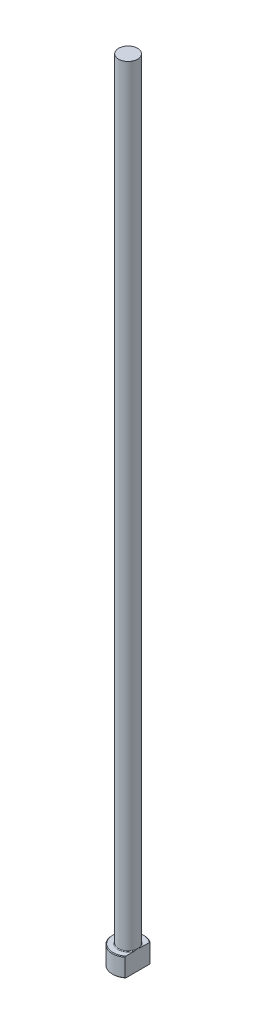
ISO-10303-21;
HEADER;
FILE_DESCRIPTION(('STEP AP214'),'2;1');
FILE_NAME('part.step','',(''),(''),'','','');
FILE_SCHEMA(('AUTOMOTIVE_DESIGN { 1 0 10303 214 1 1 1 1 }'));
ENDSEC;
DATA;
#1=APPLICATION_CONTEXT('core data for automotive mechanical design processes');
#2=APPLICATION_PROTOCOL_DEFINITION('international standard','automotive_design',2000,#1);
#3=PRODUCT_CONTEXT('',#1,'mechanical');
#4=PRODUCT('Part','Part','',(#3));
#5=PRODUCT_RELATED_PRODUCT_CATEGORY('part','',(#4));
#6=PRODUCT_DEFINITION_FORMATION('','',#4);
#7=PRODUCT_DEFINITION_CONTEXT('part definition',#1,'design');
#8=PRODUCT_DEFINITION('design','',#6,#7);
#9=PRODUCT_DEFINITION_SHAPE('','',#8);
#10=(LENGTH_UNIT() NAMED_UNIT(*) SI_UNIT(.MILLI.,.METRE.));
#11=(NAMED_UNIT(*) PLANE_ANGLE_UNIT() SI_UNIT($,.RADIAN.));
#12=(NAMED_UNIT(*) SI_UNIT($,.STERADIAN.) SOLID_ANGLE_UNIT());
#13=UNCERTAINTY_MEASURE_WITH_UNIT(LENGTH_MEASURE(1.E-05),#10,'distance_accuracy_value','');
#14=(GEOMETRIC_REPRESENTATION_CONTEXT(3) GLOBAL_UNCERTAINTY_ASSIGNED_CONTEXT((#13)) GLOBAL_UNIT_ASSIGNED_CONTEXT((#10,
#11,#12)) REPRESENTATION_CONTEXT('',''));
#15=CARTESIAN_POINT('',(0.,0.,0.));
#16=DIRECTION('',(0.,0.,1.));
#17=DIRECTION('',(1.,0.,0.));
#18=AXIS2_PLACEMENT_3D('',#15,#16,#17);
#19=CARTESIAN_POINT('',(0.,0.,0.));
#20=DIRECTION('',(0.,-1.,0.));
#21=DIRECTION('',(0.,0.,-1.));
#22=AXIS2_PLACEMENT_3D('',#19,#20,#21);
#23=PLANE('',#22);
#24=CARTESIAN_POINT('',(0.,0.,0.));
#25=DIRECTION('',(0.,-1.,0.));
#26=DIRECTION('',(0.,0.,-1.));
#27=AXIS2_PLACEMENT_3D('',#24,#25,#26);
#28=CIRCLE('',#27,4.79999999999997);
#29=CARTESIAN_POINT('',(2.99999999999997,0.,3.74699879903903));
#30=VERTEX_POINT('',#29);
#31=CARTESIAN_POINT('',(2.99999999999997,0.,-3.74699879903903));
#32=VERTEX_POINT('',#31);
#33=EDGE_CURVE('E98',#30,#32,#28,.T.);
#34=ORIENTED_EDGE('',*,*,#33,.T.);
#35=DIRECTION('',(0.,0.,1.));
#36=VECTOR('',#35,1.);
#37=CARTESIAN_POINT('',(2.99999999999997,0.,3.99999999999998));
#38=LINE('',#37,#36);
#39=EDGE_CURVE('E83',#32,#30,#38,.T.);
#40=ORIENTED_EDGE('',*,*,#39,.T.);
#41=EDGE_LOOP('',(#34,#40));
#42=FACE_BOUND('',#41,.T.);
#43=ADVANCED_FACE('F32',(#42),#23,.T.);
#44=CARTESIAN_POINT('',(0.,259.958771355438,0.));
#45=DIRECTION('',(0.,1.,0.));
#46=DIRECTION('',(0.,0.,1.));
#47=AXIS2_PLACEMENT_3D('',#44,#45,#46);
#48=CYLINDRICAL_SURFACE('',#47,4.99999999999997);
#49=CARTESIAN_POINT('',(0.,5.80000000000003,0.));
#50=DIRECTION('',(0.,1.,0.));
#51=DIRECTION('',(0.,0.,1.));
#52=AXIS2_PLACEMENT_3D('',#49,#50,#51);
#53=CIRCLE('',#52,4.99999999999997);
#54=CARTESIAN_POINT('',(2.99999999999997,5.80000000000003,3.99999999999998));
#55=VERTEX_POINT('',#54);
#56=CARTESIAN_POINT('',(2.99999999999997,5.80000000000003,-3.99999999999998));
#57=VERTEX_POINT('',#56);
#58=EDGE_CURVE('E104',#55,#57,#53,.F.);
#59=ORIENTED_EDGE('',*,*,#58,.T.);
#60=DIRECTION('',(0.,-1.,0.));
#61=VECTOR('',#60,1.);
#62=CARTESIAN_POINT('',(2.99999999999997,250.,-3.99999999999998));
#63=LINE('',#62,#61);
#64=CARTESIAN_POINT('',(2.99999999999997,0.200000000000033,-3.99999999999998));
#65=VERTEX_POINT('',#64);
#66=EDGE_CURVE('E183',#57,#65,#63,.T.);
#67=ORIENTED_EDGE('',*,*,#66,.T.);
#68=CARTESIAN_POINT('',(0.,0.200000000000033,0.));
#69=DIRECTION('',(0.,-1.,0.));
#70=DIRECTION('',(0.,0.,-1.));
#71=AXIS2_PLACEMENT_3D('',#68,#69,#70);
#72=CIRCLE('',#71,4.99999999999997);
#73=CARTESIAN_POINT('',(2.99999999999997,0.200000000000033,3.99999999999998));
#74=VERTEX_POINT('',#73);
#75=EDGE_CURVE('E100',#65,#74,#72,.F.);
#76=ORIENTED_EDGE('',*,*,#75,.T.);
#77=DIRECTION('',(0.,-1.,0.));
#78=VECTOR('',#77,1.);
#79=CARTESIAN_POINT('',(2.99999999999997,250.,3.99999999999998));
#80=LINE('',#79,#78);
#81=EDGE_CURVE('E93',#55,#74,#80,.T.);
#82=ORIENTED_EDGE('',*,*,#81,.F.);
#83=EDGE_LOOP('',(#59,#67,#76,#82));
#84=FACE_BOUND('',#83,.T.);
#85=ADVANCED_FACE('F158',(#84),#48,.T.);
#86=CARTESIAN_POINT('',(-4.99999999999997,6.,0.));
#87=DIRECTION('',(0.,1.,0.));
#88=DIRECTION('',(0.,0.,1.));
#89=AXIS2_PLACEMENT_3D('',#86,#87,#88);
#90=PLANE('',#89);
#91=CARTESIAN_POINT('',(0.,6.,0.));
#92=DIRECTION('',(0.,1.,0.));
#93=DIRECTION('',(0.,0.,1.));
#94=AXIS2_PLACEMENT_3D('',#91,#92,#93);
#95=CIRCLE('',#94,4.80000000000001);
#96=CARTESIAN_POINT('',(2.99999999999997,6.,-3.74699879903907));
#97=VERTEX_POINT('',#96);
#98=CARTESIAN_POINT('',(2.99999999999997,6.,3.74699879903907));
#99=VERTEX_POINT('',#98);
#100=EDGE_CURVE('E178',#97,#99,#95,.T.);
#101=ORIENTED_EDGE('',*,*,#100,.T.);
#102=DIRECTION('',(0.,0.,-1.));
#103=VECTOR('',#102,1.);
#104=CARTESIAN_POINT('',(2.99999999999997,6.,0.));
#105=LINE('',#104,#103);
#106=CARTESIAN_POINT('',(2.99999999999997,5.99999999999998,1.11355287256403));
#107=VERTEX_POINT('',#106);
#108=EDGE_CURVE('E57',#99,#107,#105,.T.);
#109=ORIENTED_EDGE('',*,*,#108,.T.);
#110=CARTESIAN_POINT('',(0.,6.,0.));
#111=DIRECTION('',(0.,1.,0.));
#112=DIRECTION('',(0.,0.,1.));
#113=AXIS2_PLACEMENT_3D('',#110,#111,#112);
#114=CIRCLE('',#113,3.19999999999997);
#115=CARTESIAN_POINT('',(2.99999999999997,5.99999999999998,-1.113552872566));
#116=VERTEX_POINT('',#115);
#117=EDGE_CURVE('E107',#107,#116,#114,.F.);
#118=ORIENTED_EDGE('',*,*,#117,.T.);
#119=EDGE_CURVE('E136',#116,#97,#105,.T.);
#120=ORIENTED_EDGE('',*,*,#119,.T.);
#121=EDGE_LOOP('',(#101,#109,#118,#120));
#122=FACE_BOUND('',#121,.T.);
#123=ADVANCED_FACE('F147',(#122),#90,.T.);
#124=CARTESIAN_POINT('',(0.,6.00000000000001,0.));
#125=DIRECTION('',(0.,-1.,0.));
#126=DIRECTION('',(0.,0.,-1.));
#127=AXIS2_PLACEMENT_3D('',#124,#125,#126);
#128=CONICAL_SURFACE('',#127,4.8,0.785398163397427);
#129=ORIENTED_EDGE('',*,*,#58,.F.);
#130=CARTESIAN_POINT('',(2.99999999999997,1.50107969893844,8.80169976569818));
#131=CARTESIAN_POINT('',(2.99999999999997,1.63686222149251,8.65824370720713));
#132=CARTESIAN_POINT('',(2.99999999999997,1.77246571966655,8.51461803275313));
#133=CARTESIAN_POINT('',(2.99999999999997,2.04325136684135,8.22696847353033));
#134=CARTESIAN_POINT('',(2.99999999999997,2.1784335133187,8.08294458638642));
#135=CARTESIAN_POINT('',(2.99999999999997,2.5835648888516,7.64985367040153));
#136=CARTESIAN_POINT('',(2.99999999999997,2.85278243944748,7.36010130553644));
#137=CARTESIAN_POINT('',(2.99999999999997,3.40003551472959,6.76562093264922));
#138=CARTESIAN_POINT('',(2.99999999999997,3.67795327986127,6.46078413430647));
#139=CARTESIAN_POINT('',(2.99999999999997,4.09143431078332,6.00077575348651));
#140=CARTESIAN_POINT('',(2.99999999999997,4.22862197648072,5.84706478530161));
#141=CARTESIAN_POINT('',(2.99999999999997,4.50164803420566,5.53845013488));
#142=CARTESIAN_POINT('',(2.99999999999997,4.6374864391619,5.38354646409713));
#143=CARTESIAN_POINT('',(2.99999999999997,4.90727601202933,5.07249257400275));
#144=CARTESIAN_POINT('',(2.99999999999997,5.04122961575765,4.91634447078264));
#145=CARTESIAN_POINT('',(2.99999999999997,5.30697993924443,4.60220522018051));
#146=CARTESIAN_POINT('',(2.99999999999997,5.43877654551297,4.44421397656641));
#147=CARTESIAN_POINT('',(2.99999999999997,5.69999683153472,4.1253404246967));
#148=CARTESIAN_POINT('',(2.99999999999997,5.82941047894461,3.96444987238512));
#149=CARTESIAN_POINT('',(2.99999999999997,6.08438250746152,3.63966784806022));
#150=CARTESIAN_POINT('',(2.99999999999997,6.20994148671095,3.47577684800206));
#151=CARTESIAN_POINT('',(2.99999999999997,6.45325581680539,3.14739812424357));
#152=CARTESIAN_POINT('',(2.99999999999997,6.57111776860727,2.98298986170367));
#153=CARTESIAN_POINT('',(2.99999999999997,6.79968625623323,2.64903166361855));
#154=CARTESIAN_POINT('',(2.99999999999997,6.91038738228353,2.47947797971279));
#155=CARTESIAN_POINT('',(2.99999999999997,7.12046597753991,2.13484547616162));
#156=CARTESIAN_POINT('',(2.99999999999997,7.21990868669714,1.95980688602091));
#157=CARTESIAN_POINT('',(2.99999999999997,7.40271732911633,1.60161809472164));
#158=CARTESIAN_POINT('',(2.99999999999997,7.48611382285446,1.41848414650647));
#159=CARTESIAN_POINT('',(2.99999999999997,7.5908739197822,1.14242184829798));
#160=CARTESIAN_POINT('',(2.99999999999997,7.62169870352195,1.0530881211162));
#161=CARTESIAN_POINT('',(2.99999999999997,7.67691431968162,0.872393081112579));
#162=CARTESIAN_POINT('',(2.99999999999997,7.70130307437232,0.781031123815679));
#163=CARTESIAN_POINT('',(2.99999999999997,7.74245942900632,0.597105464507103));
#164=CARTESIAN_POINT('',(2.99999999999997,7.75926776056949,0.504551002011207));
#165=CARTESIAN_POINT('',(2.99999999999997,7.78456917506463,0.318316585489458));
#166=CARTESIAN_POINT('',(2.99999999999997,7.79306431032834,0.224636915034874));
#167=CARTESIAN_POINT('',(2.99999999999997,7.80126723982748,0.0362345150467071));
#168=CARTESIAN_POINT('',(2.99999999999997,7.80091364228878,-0.0584909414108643));
#169=CARTESIAN_POINT('',(2.99999999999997,7.79128992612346,-0.247479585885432));
#170=CARTESIAN_POINT('',(2.99999999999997,7.78201974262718,-0.341742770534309));
#171=CARTESIAN_POINT('',(2.99999999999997,7.75505711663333,-0.529484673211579));
#172=CARTESIAN_POINT('',(2.99999999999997,7.73732579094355,-0.622957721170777));
#173=CARTESIAN_POINT('',(2.99999999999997,7.69436193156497,-0.808152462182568));
#174=CARTESIAN_POINT('',(2.99999999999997,7.66912783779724,-0.899873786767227));
#175=CARTESIAN_POINT('',(2.99999999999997,7.59536615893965,-1.13513447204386));
#176=CARTESIAN_POINT('',(2.99999999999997,7.54190202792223,-1.27712290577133));
#177=CARTESIAN_POINT('',(2.99999999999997,7.42288064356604,-1.55591594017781));
#178=CARTESIAN_POINT('',(2.99999999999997,7.35731341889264,-1.69271615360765));
#179=CARTESIAN_POINT('',(2.99999999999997,7.21673004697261,-1.96297343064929));
#180=CARTESIAN_POINT('',(2.99999999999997,7.14163008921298,-2.09638641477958));
#181=CARTESIAN_POINT('',(2.99999999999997,7.02409885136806,-2.2935114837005));
#182=CARTESIAN_POINT('',(2.99999999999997,6.98411579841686,-2.35870939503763));
#183=CARTESIAN_POINT('',(2.99999999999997,6.90273519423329,-2.48821412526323));
#184=CARTESIAN_POINT('',(2.99999999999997,6.86133769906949,-2.55252097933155));
#185=CARTESIAN_POINT('',(2.99999999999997,6.72108058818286,-2.76592084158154));
#186=CARTESIAN_POINT('',(2.99999999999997,6.61950942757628,-2.91323263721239));
#187=CARTESIAN_POINT('',(2.99999999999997,6.41158682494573,-3.20445576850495));
#188=CARTESIAN_POINT('',(2.99999999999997,6.30523434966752,-3.34836635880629));
#189=CARTESIAN_POINT('',(2.99999999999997,6.08891481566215,-3.6335882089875));
#190=CARTESIAN_POINT('',(2.99999999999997,5.97894537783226,-3.77489765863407));
#191=CARTESIAN_POINT('',(2.99999999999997,5.75630759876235,-4.05537908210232));
#192=CARTESIAN_POINT('',(2.99999999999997,5.64363910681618,-4.19455093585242));
#193=CARTESIAN_POINT('',(2.99999999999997,5.41585487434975,-4.47160548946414));
#194=CARTESIAN_POINT('',(2.99999999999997,5.30073257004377,-4.60948278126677));
#195=CARTESIAN_POINT('',(2.99999999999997,5.06881951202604,-4.88382857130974));
#196=CARTESIAN_POINT('',(2.99999999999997,4.95202872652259,-5.02029704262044));
#197=CARTESIAN_POINT('',(2.99999999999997,4.59976429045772,-5.42786401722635));
#198=CARTESIAN_POINT('',(2.99999999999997,4.36230070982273,-5.69724186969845));
#199=CARTESIAN_POINT('',(2.99999999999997,3.90791057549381,-6.2058433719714));
#200=CARTESIAN_POINT('',(2.99999999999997,3.69132371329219,-6.4453721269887));
#201=CARTESIAN_POINT('',(2.99999999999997,3.25600753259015,-6.92252604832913));
#202=CARTESIAN_POINT('',(2.99999999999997,3.03727796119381,-7.16015098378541));
#203=CARTESIAN_POINT('',(2.99999999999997,2.59963438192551,-7.63242038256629));
#204=CARTESIAN_POINT('',(2.99999999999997,2.38073043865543,-7.86707418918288));
#205=CARTESIAN_POINT('',(2.99999999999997,1.94172655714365,-8.33519393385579));
#206=CARTESIAN_POINT('',(2.99999999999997,1.7216268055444,-8.56866004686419));
#207=CARTESIAN_POINT('',(2.99999999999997,1.50107969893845,-8.80169976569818));
#208=B_SPLINE_CURVE_WITH_KNOTS('',3,(#130,#131,#132,#133,#134,#135,#136,#137,#138,#139,#140,
#141,#142,#143,#144,#145,#146,#147,#148,#149,#150,#151,#152,#153,#154,#155,#156,#157,#158,#159,
#160,#161,#162,#163,#164,#165,#166,#167,#168,#169,#170,#171,#172,#173,#174,#175,#176,#177,#178,
#179,#180,#181,#182,#183,#184,#185,#186,#187,#188,#189,#190,#191,#192,#193,#194,#195,#196,#197,
#198,#199,#200,#201,#202,#203,#204,#205,#206,#207),.UNSPECIFIED.,.F.,.F.,(4,2,2,2,2,2,2,2,2,2,2,
2,2,2,2,2,2,2,2,2,2,2,2,2,2,2,2,2,2,2,2,2,2,2,2,2,2,2,4),(0.,0.592578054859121,1.18515965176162,
2.37170329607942,3.60919781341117,4.22727570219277,4.84534766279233,5.46252965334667,
6.07974401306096,6.69913968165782,7.3184387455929,7.92518229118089,8.53237898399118,
9.1358544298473,9.73816890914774,10.0214813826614,10.3048852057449,10.5867475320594,
10.8685402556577,11.1522885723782,11.4360389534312,11.7211060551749,12.0062324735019,
12.4605654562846,12.9152744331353,13.3743011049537,13.6037325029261,13.8331548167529,
14.3698070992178,14.9065759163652,15.4437051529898,15.9808644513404,16.5197074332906,
17.058560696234,18.1358079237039,19.1045853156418,20.073478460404,21.0361950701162,
21.9987655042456),.UNSPECIFIED.);
#209=EDGE_CURVE('E135',#55,#99,#208,.T.);
#210=ORIENTED_EDGE('',*,*,#209,.T.);
#211=ORIENTED_EDGE('',*,*,#100,.F.);
#212=EDGE_CURVE('E127',#97,#57,#208,.T.);
#213=ORIENTED_EDGE('',*,*,#212,.T.);
#214=EDGE_LOOP('',(#129,#210,#211,#213));
#215=FACE_BOUND('',#214,.T.);
#216=ADVANCED_FACE('F143',(#215),#128,.T.);
#217=CARTESIAN_POINT('',(0.,0.200000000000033,0.));
#218=DIRECTION('',(0.,1.,0.));
#219=DIRECTION('',(0.,0.,1.));
#220=AXIS2_PLACEMENT_3D('',#217,#218,#219);
#221=CONICAL_SURFACE('',#220,4.99999999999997,0.785398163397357);
#222=ORIENTED_EDGE('',*,*,#75,.F.);
#223=CARTESIAN_POINT('',(2.99999999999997,4.49892030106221,-8.80169976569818));
#224=CARTESIAN_POINT('',(2.99999999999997,4.36313777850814,-8.65824370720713));
#225=CARTESIAN_POINT('',(2.99999999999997,4.22753428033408,-8.51461803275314));
#226=CARTESIAN_POINT('',(2.99999999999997,3.95674863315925,-8.22696847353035));
#227=CARTESIAN_POINT('',(2.99999999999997,3.82156648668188,-8.08294458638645));
#228=CARTESIAN_POINT('',(2.99999999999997,3.41643511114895,-7.64985367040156));
#229=CARTESIAN_POINT('',(2.99999999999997,3.14721756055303,-7.36010130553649));
#230=CARTESIAN_POINT('',(2.99999999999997,2.59996448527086,-6.76562093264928));
#231=CARTESIAN_POINT('',(2.99999999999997,2.32204672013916,-6.46078413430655));
#232=CARTESIAN_POINT('',(2.99999999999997,1.90856568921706,-6.0007757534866));
#233=CARTESIAN_POINT('',(2.99999999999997,1.77137802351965,-5.84706478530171));
#234=CARTESIAN_POINT('',(2.99999999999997,1.49835196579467,-5.5384501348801));
#235=CARTESIAN_POINT('',(2.99999999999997,1.36251356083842,-5.38354646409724));
#236=CARTESIAN_POINT('',(2.99999999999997,1.09272398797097,-5.07249257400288));
#237=CARTESIAN_POINT('',(2.99999999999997,0.958770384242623,-4.91634447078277));
#238=CARTESIAN_POINT('',(2.99999999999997,0.693020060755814,-4.60220522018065));
#239=CARTESIAN_POINT('',(2.99999999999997,0.561223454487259,-4.44421397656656));
#240=CARTESIAN_POINT('',(2.99999999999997,0.300003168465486,-4.12534042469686));
#241=CARTESIAN_POINT('',(2.99999999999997,0.170589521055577,-3.96444987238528));
#242=CARTESIAN_POINT('',(2.99999999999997,-0.0843825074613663,-3.63966784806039));
#243=CARTESIAN_POINT('',(2.99999999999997,-0.209941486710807,-3.47577684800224));
#244=CARTESIAN_POINT('',(2.99999999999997,-0.45325581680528,-3.14739812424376));
#245=CARTESIAN_POINT('',(2.99999999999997,-0.57111776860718,-2.98298986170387));
#246=CARTESIAN_POINT('',(2.99999999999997,-0.799686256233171,-2.64903166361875));
#247=CARTESIAN_POINT('',(2.99999999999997,-0.910387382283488,-2.479477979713));
#248=CARTESIAN_POINT('',(2.99999999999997,-1.12046597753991,-2.13484547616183));
#249=CARTESIAN_POINT('',(2.99999999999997,-1.21990868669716,-1.95980688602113));
#250=CARTESIAN_POINT('',(2.99999999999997,-1.40271732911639,-1.60161809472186));
#251=CARTESIAN_POINT('',(2.99999999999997,-1.48611382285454,-1.4184841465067));
#252=CARTESIAN_POINT('',(2.99999999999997,-1.5908739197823,-1.14242184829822));
#253=CARTESIAN_POINT('',(2.99999999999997,-1.62169870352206,-1.05308812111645));
#254=CARTESIAN_POINT('',(2.99999999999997,-1.67691431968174,-0.872393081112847));
#255=CARTESIAN_POINT('',(2.99999999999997,-1.70130307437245,-0.781031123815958));
#256=CARTESIAN_POINT('',(2.99999999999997,-1.74245942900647,-0.597105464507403));
#257=CARTESIAN_POINT('',(2.99999999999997,-1.75926776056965,-0.504551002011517));
#258=CARTESIAN_POINT('',(2.99999999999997,-1.78456917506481,-0.318316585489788));
#259=CARTESIAN_POINT('',(2.99999999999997,-1.79306431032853,-0.224636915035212));
#260=CARTESIAN_POINT('',(2.99999999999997,-1.80126723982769,-0.0362345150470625));
#261=CARTESIAN_POINT('',(2.99999999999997,-1.800913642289,0.0584909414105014));
#262=CARTESIAN_POINT('',(2.99999999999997,-1.79128992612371,0.247479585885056));
#263=CARTESIAN_POINT('',(2.99999999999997,-1.78201974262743,0.341742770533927));
#264=CARTESIAN_POINT('',(2.99999999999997,-1.75505711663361,0.529484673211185));
#265=CARTESIAN_POINT('',(2.99999999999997,-1.73732579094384,0.622957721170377));
#266=CARTESIAN_POINT('',(2.99999999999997,-1.69436193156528,0.808152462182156));
#267=CARTESIAN_POINT('',(2.99999999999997,-1.66912783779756,0.899873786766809));
#268=CARTESIAN_POINT('',(2.99999999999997,-1.59536615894,1.13513447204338));
#269=CARTESIAN_POINT('',(2.99999999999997,-1.54190202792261,1.2771229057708));
#270=CARTESIAN_POINT('',(2.99999999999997,-1.42288064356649,1.55591594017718));
#271=CARTESIAN_POINT('',(2.99999999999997,-1.35731341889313,1.69271615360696));
#272=CARTESIAN_POINT('',(2.99999999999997,-1.21673004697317,1.9629734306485));
#273=CARTESIAN_POINT('',(2.99999999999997,-1.14163008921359,2.09638641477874));
#274=CARTESIAN_POINT('',(2.99999999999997,-1.02409885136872,2.29351148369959));
#275=CARTESIAN_POINT('',(2.99999999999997,-0.984115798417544,2.3587093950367));
#276=CARTESIAN_POINT('',(2.99999999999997,-0.902735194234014,2.48821412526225));
#277=CARTESIAN_POINT('',(2.99999999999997,-0.861337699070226,2.55252097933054));
#278=CARTESIAN_POINT('',(2.99999999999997,-0.721080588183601,2.76592084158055));
#279=CARTESIAN_POINT('',(2.99999999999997,-0.619509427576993,2.91323263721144));
#280=CARTESIAN_POINT('',(2.99999999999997,-0.411586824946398,3.20445576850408));
#281=CARTESIAN_POINT('',(2.99999999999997,-0.305234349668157,3.34836635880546));
#282=CARTESIAN_POINT('',(2.99999999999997,-0.0889148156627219,3.63358820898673));
#283=CARTESIAN_POINT('',(2.99999999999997,0.0210546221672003,3.77489765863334));
#284=CARTESIAN_POINT('',(2.99999999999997,0.243692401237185,4.05537908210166));
#285=CARTESIAN_POINT('',(2.99999999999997,0.356360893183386,4.19455093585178));
#286=CARTESIAN_POINT('',(2.99999999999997,0.58414512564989,4.47160548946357));
#287=CARTESIAN_POINT('',(2.99999999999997,0.699267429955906,4.60948278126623));
#288=CARTESIAN_POINT('',(2.99999999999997,0.93118048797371,4.88382857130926));
#289=CARTESIAN_POINT('',(2.99999999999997,1.0479712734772,5.02029704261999));
#290=CARTESIAN_POINT('',(2.99999999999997,1.4002357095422,5.42786401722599));
#291=CARTESIAN_POINT('',(2.99999999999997,1.63769929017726,5.69724186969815));
#292=CARTESIAN_POINT('',(2.99999999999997,2.09208942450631,6.20584337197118));
#293=CARTESIAN_POINT('',(2.99999999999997,2.30867628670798,6.4453721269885));
#294=CARTESIAN_POINT('',(2.99999999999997,2.74399246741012,6.92252604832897));
#295=CARTESIAN_POINT('',(2.99999999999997,2.96272203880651,7.16015098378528));
#296=CARTESIAN_POINT('',(2.99999999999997,3.40036561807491,7.63242038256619));
#297=CARTESIAN_POINT('',(2.99999999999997,3.61926956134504,7.86707418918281));
#298=CARTESIAN_POINT('',(2.99999999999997,4.05827344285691,8.33519393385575));
#299=CARTESIAN_POINT('',(2.99999999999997,4.27837319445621,8.56866004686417));
#300=CARTESIAN_POINT('',(2.99999999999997,4.49892030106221,8.80169976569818));
#301=B_SPLINE_CURVE_WITH_KNOTS('',3,(#223,#224,#225,#226,#227,#228,#229,#230,#231,#232,#233,
#234,#235,#236,#237,#238,#239,#240,#241,#242,#243,#244,#245,#246,#247,#248,#249,#250,#251,#252,
#253,#254,#255,#256,#257,#258,#259,#260,#261,#262,#263,#264,#265,#266,#267,#268,#269,#270,#271,
#272,#273,#274,#275,#276,#277,#278,#279,#280,#281,#282,#283,#284,#285,#286,#287,#288,#289,#290,
#291,#292,#293,#294,#295,#296,#297,#298,#299,#300),.UNSPECIFIED.,.F.,.F.,(4,2,2,2,2,2,2,2,2,2,2,
2,2,2,2,2,2,2,2,2,2,2,2,2,2,2,2,2,2,2,2,2,2,2,2,2,2,2,4),(0.,0.592578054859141,1.18515965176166,
2.3717032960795,3.60919781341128,4.22727570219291,4.84534766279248,5.46252965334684,
6.07974401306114,6.69913968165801,7.31843874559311,7.92518229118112,8.53237898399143,
9.13585442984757,9.73816890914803,10.0214813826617,10.3048852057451,10.5867475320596,
10.8685402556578,11.1522885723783,11.4360389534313,11.721106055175,12.006232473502,
12.4605654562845,12.915274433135,13.3743011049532,13.6037325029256,13.8331548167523,
14.3698070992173,14.9065759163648,15.4437051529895,15.9808644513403,16.5197074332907,
17.0585606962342,18.1358079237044,19.1045853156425,20.0734784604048,21.0361950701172,
21.9987655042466),.UNSPECIFIED.);
#302=EDGE_CURVE('E86',#65,#32,#301,.T.);
#303=ORIENTED_EDGE('',*,*,#302,.T.);
#304=ORIENTED_EDGE('',*,*,#33,.F.);
#305=EDGE_CURVE('E89',#30,#74,#301,.T.);
#306=ORIENTED_EDGE('',*,*,#305,.T.);
#307=EDGE_LOOP('',(#222,#303,#304,#306));
#308=FACE_BOUND('',#307,.T.);
#309=ADVANCED_FACE('F97',(#308),#221,.T.);
#310=CARTESIAN_POINT('',(0.,6.19999999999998,0.));
#311=DIRECTION('',(0.,1.,0.));
#312=DIRECTION('',(0.,0.,1.));
#313=AXIS2_PLACEMENT_3D('',#310,#311,#312);
#314=TOROIDAL_SURFACE('',#313,3.19999999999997,0.2);
#315=CARTESIAN_POINT('',(2.99999999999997,6.19999999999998,0.));
#316=CARTESIAN_POINT('',(2.99999999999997,6.20000054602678,-8.25590029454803E-09));
#317=CARTESIAN_POINT('',(2.99999999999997,6.20000108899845,-2.22623717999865E-07));
#318=CARTESIAN_POINT('',(2.99999999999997,6.20000210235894,-8.13181332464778E-07));
#319=CARTESIAN_POINT('',(2.99999999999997,6.20000256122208,-1.20262210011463E-06));
#320=CARTESIAN_POINT('',(2.99999999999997,6.20000351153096,-2.13233194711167E-06));
#321=CARTESIAN_POINT('',(2.99999999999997,6.20000398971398,-2.68711080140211E-06));
#322=CARTESIAN_POINT('',(2.99999999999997,6.20000484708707,-3.8372299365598E-06));
#323=CARTESIAN_POINT('',(2.99999999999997,6.20000522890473,-4.43075975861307E-06));
#324=CARTESIAN_POINT('',(2.99999999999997,6.20000663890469,-6.718054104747E-06));
#325=CARTESIAN_POINT('',(2.99999999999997,6.20000758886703,-8.46267334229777E-06));
#326=CARTESIAN_POINT('',(2.99999999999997,6.20000915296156,-1.19195939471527E-05));
#327=CARTESIAN_POINT('',(2.99999999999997,6.20000978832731,-1.36226968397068E-05));
#328=CARTESIAN_POINT('',(2.99999999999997,6.20001243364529,-2.07785329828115E-05));
#329=CARTESIAN_POINT('',(2.99999999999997,6.20001439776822,-2.62512689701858E-05));
#330=CARTESIAN_POINT('',(2.99999999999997,6.20001730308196,-3.65971254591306E-05));
#331=CARTESIAN_POINT('',(2.99999999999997,6.20001835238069,-4.14397204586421E-05));
#332=CARTESIAN_POINT('',(2.99999999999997,6.20002589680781,-7.68826112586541E-05));
#333=CARTESIAN_POINT('',(2.99999999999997,6.20003169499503,-0.000107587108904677));
#334=CARTESIAN_POINT('',(2.99999999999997,6.20005649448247,-0.000225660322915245));
#335=CARTESIAN_POINT('',(2.99999999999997,6.20007997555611,-0.000312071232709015));
#336=CARTESIAN_POINT('',(2.99999999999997,6.20016717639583,-0.00063874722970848));
#337=CARTESIAN_POINT('',(2.99999999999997,6.20022823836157,-0.00087949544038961));
#338=CARTESIAN_POINT('',(2.99999999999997,6.20046253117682,-0.00179757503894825));
#339=CARTESIAN_POINT('',(2.99999999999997,6.20063826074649,-0.00247448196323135));
#340=CARTESIAN_POINT('',(2.99999999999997,6.20145771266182,-0.00563611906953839));
#341=CARTESIAN_POINT('',(2.99999999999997,6.20209802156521,-0.00812138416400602));
#342=CARTESIAN_POINT('',(2.99999999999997,6.20747052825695,-0.0289666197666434));
#343=CARTESIAN_POINT('',(2.99999999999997,6.21221441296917,-0.0473249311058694));
#344=CARTESIAN_POINT('',(2.99999999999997,6.22150414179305,-0.0833908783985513));
#345=CARTESIAN_POINT('',(2.99999999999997,6.22605099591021,-0.101098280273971));
#346=CARTESIAN_POINT('',(2.99999999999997,6.24071513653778,-0.158441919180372));
#347=CARTESIAN_POINT('',(2.99999999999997,6.25076238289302,-0.198096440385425));
#348=CARTESIAN_POINT('',(2.99999999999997,6.2673587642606,-0.264903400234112));
#349=CARTESIAN_POINT('',(2.99999999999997,6.27400650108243,-0.292031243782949));
#350=CARTESIAN_POINT('',(2.99999999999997,6.28691139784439,-0.345693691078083));
#351=CARTESIAN_POINT('',(2.99999999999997,6.2931740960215,-0.372226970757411));
#352=CARTESIAN_POINT('',(2.99999999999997,6.31359314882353,-0.460847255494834));
#353=CARTESIAN_POINT('',(2.99999999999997,6.32711949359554,-0.523084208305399));
#354=CARTESIAN_POINT('',(2.99999999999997,6.35185224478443,-0.648627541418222));
#355=CARTESIAN_POINT('',(2.99999999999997,6.36303576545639,-0.711938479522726));
#356=CARTESIAN_POINT('',(2.99999999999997,6.38269719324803,-0.845442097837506));
#357=CARTESIAN_POINT('',(2.99999999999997,6.39079783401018,-0.915695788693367));
#358=CARTESIAN_POINT('',(2.99999999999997,6.39788104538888,-1.02128246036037));
#359=CARTESIAN_POINT('',(2.99999999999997,6.39939945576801,-1.05644278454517));
#360=CARTESIAN_POINT('',(2.99999999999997,6.40031405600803,-1.12678521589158));
#361=CARTESIAN_POINT('',(2.99999999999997,6.39971158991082,-1.16196729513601));
#362=CARTESIAN_POINT('',(2.99999999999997,6.39660553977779,-1.21713951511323));
#363=CARTESIAN_POINT('',(2.99999999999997,6.39502683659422,-1.23718181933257));
#364=CARTESIAN_POINT('',(2.99999999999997,6.39080008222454,-1.27717351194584));
#365=CARTESIAN_POINT('',(2.99999999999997,6.38815120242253,-1.29712281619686));
#366=CARTESIAN_POINT('',(2.99999999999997,6.38160570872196,-1.33655702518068));
#367=CARTESIAN_POINT('',(2.99999999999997,6.37772556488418,-1.35604460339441));
#368=CARTESIAN_POINT('',(2.99999999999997,6.36841119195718,-1.39463554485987));
#369=CARTESIAN_POINT('',(2.99999999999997,6.36297874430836,-1.41373932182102));
#370=CARTESIAN_POINT('',(2.99999999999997,6.3500393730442,-1.45151809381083));
#371=CARTESIAN_POINT('',(2.99999999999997,6.34250654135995,-1.4701843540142));
#372=CARTESIAN_POINT('',(2.99999999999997,6.32469433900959,-1.50617232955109));
#373=CARTESIAN_POINT('',(2.99999999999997,6.31442814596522,-1.52349999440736));
#374=CARTESIAN_POINT('',(2.99999999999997,6.29768486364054,-1.5453003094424));
#375=CARTESIAN_POINT('',(2.99999999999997,6.29285641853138,-1.551032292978));
#376=CARTESIAN_POINT('',(2.99999999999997,6.28257691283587,-1.56192749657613));
#377=CARTESIAN_POINT('',(2.99999999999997,6.27712536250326,-1.56709026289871));
#378=CARTESIAN_POINT('',(2.99999999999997,6.26548354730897,-1.57666725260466));
#379=CARTESIAN_POINT('',(2.99999999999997,6.25928560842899,-1.58107232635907));
#380=CARTESIAN_POINT('',(2.99999999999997,6.24620912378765,-1.5887219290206));
#381=CARTESIAN_POINT('',(2.99999999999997,6.23933242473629,-1.59196950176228));
#382=CARTESIAN_POINT('',(2.99999999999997,6.2270240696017,-1.5962468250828));
#383=CARTESIAN_POINT('',(2.99999999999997,6.2217197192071,-1.59764171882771));
#384=CARTESIAN_POINT('',(2.99999999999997,6.2109516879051,-1.59951721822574));
#385=CARTESIAN_POINT('',(2.99999999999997,6.20548813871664,-1.59999855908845));
#386=CARTESIAN_POINT('',(2.99999999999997,6.19455397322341,-1.60000143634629));
#387=CARTESIAN_POINT('',(2.99999999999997,6.18908335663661,-1.59952177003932));
#388=CARTESIAN_POINT('',(2.99999999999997,6.17830149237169,-1.59764696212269));
#389=CARTESIAN_POINT('',(2.99999999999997,6.17299036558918,-1.59625114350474));
#390=CARTESIAN_POINT('',(2.99999999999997,6.16137413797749,-1.5922159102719));
#391=CARTESIAN_POINT('',(2.99999999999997,6.15514663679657,-1.58935479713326));
#392=CARTESIAN_POINT('',(2.99999999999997,6.14323789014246,-1.58266473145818));
#393=CARTESIAN_POINT('',(2.99999999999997,6.13755768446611,-1.57883398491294));
#394=CARTESIAN_POINT('',(2.99999999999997,6.12388989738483,-1.5682309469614));
#395=CARTESIAN_POINT('',(2.99999999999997,6.11627920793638,-1.5609769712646));
#396=CARTESIAN_POINT('',(2.99999999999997,6.10222993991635,-1.54541986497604));
#397=CARTESIAN_POINT('',(2.99999999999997,6.09579438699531,-1.53711411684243));
#398=CARTESIAN_POINT('',(2.99999999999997,6.07874447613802,-1.51234359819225));
#399=CARTESIAN_POINT('',(2.99999999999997,6.06934681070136,-1.49505024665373));
#400=CARTESIAN_POINT('',(2.99999999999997,6.05300413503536,-1.45936637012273));
#401=CARTESIAN_POINT('',(2.99999999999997,6.04606563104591,-1.44097308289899));
#402=CARTESIAN_POINT('',(2.99999999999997,6.03343712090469,-1.40170303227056));
#403=CARTESIAN_POINT('',(2.99999999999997,6.02794514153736,-1.38076360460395));
#404=CARTESIAN_POINT('',(2.99999999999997,6.01869119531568,-1.33849708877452));
#405=CARTESIAN_POINT('',(2.99999999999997,6.01493126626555,-1.31716957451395));
#406=CARTESIAN_POINT('',(2.99999999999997,6.00879575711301,-1.27427301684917));
#407=CARTESIAN_POINT('',(2.99999999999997,6.0064232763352,-1.25270354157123));
#408=CARTESIAN_POINT('',(2.99999999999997,6.00283272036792,-1.2094871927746));
#409=CARTESIAN_POINT('',(2.99999999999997,6.00161392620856,-1.18784037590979));
#410=CARTESIAN_POINT('',(2.99999999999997,5.99921193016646,-1.11739576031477));
#411=CARTESIAN_POINT('',(2.99999999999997,5.99998309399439,-1.06853061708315));
#412=CARTESIAN_POINT('',(2.99999999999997,6.0049845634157,-0.970964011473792));
#413=CARTESIAN_POINT('',(2.99999999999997,6.00921876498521,-0.922262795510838));
#414=CARTESIAN_POINT('',(2.99999999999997,6.02027934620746,-0.825023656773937));
#415=CARTESIAN_POINT('',(2.99999999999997,6.02711306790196,-0.776486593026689));
#416=CARTESIAN_POINT('',(2.99999999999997,6.04272509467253,-0.679720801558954));
#417=CARTESIAN_POINT('',(2.99999999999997,6.05150395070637,-0.631492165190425));
#418=CARTESIAN_POINT('',(2.99999999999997,6.07999589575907,-0.487173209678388));
#419=CARTESIAN_POINT('',(2.99999999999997,6.10185558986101,-0.39151417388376));
#420=CARTESIAN_POINT('',(2.99999999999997,6.14819769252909,-0.200831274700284));
#421=CARTESIAN_POINT('',(2.99999999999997,6.17268119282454,-0.105807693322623));
#422=CARTESIAN_POINT('',(2.99999999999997,6.19722910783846,-0.01073189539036));
#423=CARTESIAN_POINT('',(2.99999999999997,6.1972452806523,-0.0106692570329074));
#424=CARTESIAN_POINT('',(2.99999999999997,6.19781243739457,-0.00847232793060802));
#425=CARTESIAN_POINT('',(2.99999999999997,6.19836102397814,-0.00633759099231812));
#426=CARTESIAN_POINT('',(2.99999999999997,6.19915976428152,-0.00325873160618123));
#427=CARTESIAN_POINT('',(2.99999999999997,6.19940591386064,-0.0023138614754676));
#428=CARTESIAN_POINT('',(2.99999999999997,6.19972567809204,-0.00105818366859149));
#429=CARTESIAN_POINT('',(2.99999999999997,6.1998040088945,-0.000748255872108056));
#430=CARTESIAN_POINT('',(2.99999999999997,6.19991224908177,-0.0003408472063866));
#431=CARTESIAN_POINT('',(2.99999999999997,6.19993871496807,-0.000242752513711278));
#432=CARTESIAN_POINT('',(2.99999999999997,6.1999662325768,-0.000111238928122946));
#433=CARTESIAN_POINT('',(2.99999999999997,6.19997237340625,-7.8903777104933E-05));
#434=CARTESIAN_POINT('',(2.99999999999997,6.19998062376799,-4.17973013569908E-05));
#435=CARTESIAN_POINT('',(2.99999999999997,6.1999817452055,-3.68646326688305E-05));
#436=CARTESIAN_POINT('',(2.99999999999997,6.19998486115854,-2.63337098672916E-05));
#437=CARTESIAN_POINT('',(2.99999999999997,6.19998697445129,-2.07707790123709E-05));
#438=CARTESIAN_POINT('',(2.99999999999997,6.19998981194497,-1.35213137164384E-05));
#439=CARTESIAN_POINT('',(2.99999999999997,6.19999048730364,-1.18115060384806E-05));
#440=CARTESIAN_POINT('',(2.99999999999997,6.19999214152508,-8.34771964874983E-06));
#441=CARTESIAN_POINT('',(2.99999999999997,6.19999314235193,-6.60378872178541E-06));
#442=CARTESIAN_POINT('',(2.99999999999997,6.19999462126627,-4.32501646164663E-06));
#443=CARTESIAN_POINT('',(2.99999999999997,6.19999502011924,-3.73587510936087E-06));
#444=CARTESIAN_POINT('',(2.99999999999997,6.19999591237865,-2.59760769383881E-06));
#445=CARTESIAN_POINT('',(2.99999999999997,6.19999640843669,-2.05040430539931E-06));
#446=CARTESIAN_POINT('',(2.99999999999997,6.19999738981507,-1.1384674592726E-06));
#447=CARTESIAN_POINT('',(2.99999999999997,6.1999978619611,-7.58552555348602E-07));
#448=CARTESIAN_POINT('',(2.99999999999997,6.19999889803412,-1.92079007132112E-07));
#449=CARTESIAN_POINT('',(2.99999999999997,6.19999945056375,8.30745072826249E-09));
#450=CARTESIAN_POINT('',(2.99999999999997,6.19999999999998,0.));
#451=B_SPLINE_CURVE_WITH_KNOTS('',3,(#315,#316,#317,#318,#319,#320,#321,#322,#323,#324,#325,
#326,#327,#328,#329,#330,#331,#332,#333,#334,#335,#336,#337,#338,#339,#340,#341,#342,#343,#344,
#345,#346,#347,#348,#349,#350,#351,#352,#353,#354,#355,#356,#357,#358,#359,#360,#361,#362,#363,
#364,#365,#366,#367,#368,#369,#370,#371,#372,#373,#374,#375,#376,#377,#378,#379,#380,#381,#382,
#383,#384,#385,#386,#387,#388,#389,#390,#391,#392,#393,#394,#395,#396,#397,#398,#399,#400,#401,
#402,#403,#404,#405,#406,#407,#408,#409,#410,#411,#412,#413,#414,#415,#416,#417,#418,#419,#420,
#421,#422,#423,#424,#425,#426,#427,#428,#429,#430,#431,#432,#433,#434,#435,#436,#437,#438,#439,
#440,#441,#442,#443,#444,#445,#446,#447,#448,#449,#450),.UNSPECIFIED.,.T.,.F.,(4,2,2,2,2,2,2,2,
2,2,2,2,2,2,2,2,2,2,2,2,2,2,2,2,2,2,2,2,2,2,2,2,2,2,2,2,2,2,2,2,2,2,2,2,2,2,2,2,2,2,2,2,2,2,2,2,
2,2,2,2,2,2,2,2,2,2,2,4),(0.,1.65204690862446E-06,3.45848791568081E-06,5.64280248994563E-06,
7.75882419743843E-06,1.36969709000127E-05,1.91454439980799E-05,3.65603921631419E-05,
5.14083081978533E-05,0.000145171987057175,0.00041354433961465,0.00115890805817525,
0.00325667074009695,0.0109563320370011,0.0678386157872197,0.12268455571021,0.245405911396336,
0.329196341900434,0.410983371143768,0.602016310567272,0.794836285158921,1.0067376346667,
1.11227258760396,1.21774067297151,1.27803175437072,1.33836960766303,1.39793215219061,
1.45742661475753,1.51769013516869,1.57766822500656,1.60011625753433,1.62258205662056,
1.64530254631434,1.66796284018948,1.68434680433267,1.70071757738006,1.71710885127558,
1.7335122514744,1.75395806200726,1.77444198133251,1.8058056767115,1.83724902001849,
1.89596356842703,1.95483231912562,2.01967230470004,2.08458838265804,2.14964892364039,
2.21466889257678,2.36107995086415,2.50765595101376,2.65464904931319,2.8016838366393,
3.09594779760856,3.39033467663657,3.39052875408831,3.39714155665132,3.40007033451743,
3.40102967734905,3.40133420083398,3.40143296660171,3.40144812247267,3.4014659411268,
3.40147145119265,3.40147746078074,3.40147959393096,3.40148179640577,3.40148361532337,
3.40148527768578),.UNSPECIFIED.);
#452=CARTESIAN_POINT('',(2.99999999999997,6.19999999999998,0.));
#453=VERTEX_POINT('',#452);
#454=EDGE_CURVE('E11',#116,#453,#451,.T.);
#455=ORIENTED_EDGE('',*,*,#454,.F.);
#456=ORIENTED_EDGE('',*,*,#117,.F.);
#457=CARTESIAN_POINT('',(2.99999999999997,6.19999999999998,0.));
#458=CARTESIAN_POINT('',(2.99999999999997,6.19999945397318,8.25590052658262E-09));
#459=CARTESIAN_POINT('',(2.99999999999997,6.19999891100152,2.22623718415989E-07));
#460=CARTESIAN_POINT('',(2.99999999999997,6.19999789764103,8.13181332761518E-07));
#461=CARTESIAN_POINT('',(2.99999999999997,6.19999743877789,1.2026221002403E-06));
#462=CARTESIAN_POINT('',(2.99999999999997,6.19999648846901,2.13233194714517E-06));
#463=CARTESIAN_POINT('',(2.99999999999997,6.19999601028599,2.68711080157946E-06));
#464=CARTESIAN_POINT('',(2.99999999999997,6.1999951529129,3.83722993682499E-06));
#465=CARTESIAN_POINT('',(2.99999999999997,6.19999477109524,4.43075975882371E-06));
#466=CARTESIAN_POINT('',(2.99999999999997,6.19999336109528,6.7180541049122E-06));
#467=CARTESIAN_POINT('',(2.99999999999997,6.19999241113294,8.4626733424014E-06));
#468=CARTESIAN_POINT('',(2.99999999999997,6.19999084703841,1.19195939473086E-05));
#469=CARTESIAN_POINT('',(2.99999999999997,6.19999021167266,1.36226968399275E-05));
#470=CARTESIAN_POINT('',(2.99999999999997,6.19998756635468,2.07785329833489E-05));
#471=CARTESIAN_POINT('',(2.99999999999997,6.19998560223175,2.62512689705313E-05));
#472=CARTESIAN_POINT('',(2.99999999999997,6.19998269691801,3.65971254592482E-05));
#473=CARTESIAN_POINT('',(2.99999999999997,6.19998164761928,4.14397204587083E-05));
#474=CARTESIAN_POINT('',(2.99999999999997,6.19997410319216,7.68826112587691E-05));
#475=CARTESIAN_POINT('',(2.99999999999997,6.19996830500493,0.000107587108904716));
#476=CARTESIAN_POINT('',(2.99999999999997,6.1999435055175,0.000225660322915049));
#477=CARTESIAN_POINT('',(2.99999999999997,6.19992002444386,0.000312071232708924));
#478=CARTESIAN_POINT('',(2.99999999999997,6.19983282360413,0.000638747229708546));
#479=CARTESIAN_POINT('',(2.99999999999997,6.1997717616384,0.000879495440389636));
#480=CARTESIAN_POINT('',(2.99999999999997,6.19953746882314,0.00179757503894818));
#481=CARTESIAN_POINT('',(2.99999999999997,6.19936173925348,0.00247448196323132));
#482=CARTESIAN_POINT('',(2.99999999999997,6.19854228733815,0.0056361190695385));
#483=CARTESIAN_POINT('',(2.99999999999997,6.19790197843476,0.00812138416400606));
#484=CARTESIAN_POINT('',(2.99999999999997,6.19252947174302,0.0289666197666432));
#485=CARTESIAN_POINT('',(2.99999999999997,6.1877855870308,0.0473249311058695));
#486=CARTESIAN_POINT('',(2.99999999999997,6.17849585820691,0.0833908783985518));
#487=CARTESIAN_POINT('',(2.99999999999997,6.17394900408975,0.101098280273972));
#488=CARTESIAN_POINT('',(2.99999999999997,6.15928486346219,0.158441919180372));
#489=CARTESIAN_POINT('',(2.99999999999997,6.14923761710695,0.198096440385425));
#490=CARTESIAN_POINT('',(2.99999999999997,6.13264123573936,0.264903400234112));
#491=CARTESIAN_POINT('',(2.99999999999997,6.12599349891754,0.292031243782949));
#492=CARTESIAN_POINT('',(2.99999999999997,6.11308860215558,0.345693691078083));
#493=CARTESIAN_POINT('',(2.99999999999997,6.10682590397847,0.372226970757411));
#494=CARTESIAN_POINT('',(2.99999999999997,6.08640685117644,0.460847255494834));
#495=CARTESIAN_POINT('',(2.99999999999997,6.07288050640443,0.523084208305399));
#496=CARTESIAN_POINT('',(2.99999999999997,6.04814775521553,0.648627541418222));
#497=CARTESIAN_POINT('',(2.99999999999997,6.03696423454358,0.711938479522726));
#498=CARTESIAN_POINT('',(2.99999999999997,6.01730280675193,0.845442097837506));
#499=CARTESIAN_POINT('',(2.99999999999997,6.00920216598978,0.915695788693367));
#500=CARTESIAN_POINT('',(2.99999999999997,6.00211895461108,1.02128246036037));
#501=CARTESIAN_POINT('',(2.99999999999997,6.00060054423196,1.05644278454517));
#502=CARTESIAN_POINT('',(2.99999999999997,5.99968594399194,1.12678521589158));
#503=CARTESIAN_POINT('',(2.99999999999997,6.00028841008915,1.16196729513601));
#504=CARTESIAN_POINT('',(2.99999999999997,6.00339446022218,1.21713951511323));
#505=CARTESIAN_POINT('',(2.99999999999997,6.00497316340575,1.23718181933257));
#506=CARTESIAN_POINT('',(2.99999999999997,6.00919991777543,1.27717351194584));
#507=CARTESIAN_POINT('',(2.99999999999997,6.01184879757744,1.29712281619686));
#508=CARTESIAN_POINT('',(2.99999999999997,6.01839429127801,1.33655702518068));
#509=CARTESIAN_POINT('',(2.99999999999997,6.02227443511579,1.35604460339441));
#510=CARTESIAN_POINT('',(2.99999999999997,6.03158880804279,1.39463554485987));
#511=CARTESIAN_POINT('',(2.99999999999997,6.0370212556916,1.41373932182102));
#512=CARTESIAN_POINT('',(2.99999999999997,6.04996062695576,1.45151809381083));
#513=CARTESIAN_POINT('',(2.99999999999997,6.05749345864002,1.4701843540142));
#514=CARTESIAN_POINT('',(2.99999999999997,6.07530566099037,1.50617232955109));
#515=CARTESIAN_POINT('',(2.99999999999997,6.08557185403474,1.52349999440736));
#516=CARTESIAN_POINT('',(2.99999999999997,6.10231513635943,1.5453003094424));
#517=CARTESIAN_POINT('',(2.99999999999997,6.10714358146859,1.551032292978));
#518=CARTESIAN_POINT('',(2.99999999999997,6.1174230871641,1.56192749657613));
#519=CARTESIAN_POINT('',(2.99999999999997,6.1228746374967,1.56709026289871));
#520=CARTESIAN_POINT('',(2.99999999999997,6.13451645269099,1.57666725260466));
#521=CARTESIAN_POINT('',(2.99999999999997,6.14071439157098,1.58107232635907));
#522=CARTESIAN_POINT('',(2.99999999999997,6.15379087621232,1.5887219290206));
#523=CARTESIAN_POINT('',(2.99999999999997,6.16066757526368,1.59196950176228));
#524=CARTESIAN_POINT('',(2.99999999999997,6.17297593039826,1.5962468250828));
#525=CARTESIAN_POINT('',(2.99999999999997,6.17828028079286,1.59764171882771));
#526=CARTESIAN_POINT('',(2.99999999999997,6.18904831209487,1.59951721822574));
#527=CARTESIAN_POINT('',(2.99999999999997,6.19451186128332,1.59999855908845));
#528=CARTESIAN_POINT('',(2.99999999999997,6.20544602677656,1.60000143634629));
#529=CARTESIAN_POINT('',(2.99999999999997,6.21091664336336,1.59952177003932));
#530=CARTESIAN_POINT('',(2.99999999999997,6.22169850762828,1.59764696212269));
#531=CARTESIAN_POINT('',(2.99999999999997,6.22700963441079,1.59625114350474));
#532=CARTESIAN_POINT('',(2.99999999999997,6.23862586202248,1.5922159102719));
#533=CARTESIAN_POINT('',(2.99999999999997,6.2448533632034,1.58935479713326));
#534=CARTESIAN_POINT('',(2.99999999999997,6.25676210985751,1.58266473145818));
#535=CARTESIAN_POINT('',(2.99999999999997,6.26244231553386,1.57883398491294));
#536=CARTESIAN_POINT('',(2.99999999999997,6.27611010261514,1.5682309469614));
#537=CARTESIAN_POINT('',(2.99999999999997,6.28372079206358,1.5609769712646));
#538=CARTESIAN_POINT('',(2.99999999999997,6.29777006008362,1.54541986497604));
#539=CARTESIAN_POINT('',(2.99999999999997,6.30420561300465,1.53711411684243));
#540=CARTESIAN_POINT('',(2.99999999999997,6.32125552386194,1.51234359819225));
#541=CARTESIAN_POINT('',(2.99999999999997,6.33065318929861,1.49505024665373));
#542=CARTESIAN_POINT('',(2.99999999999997,6.3469958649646,1.45936637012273));
#543=CARTESIAN_POINT('',(2.99999999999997,6.35393436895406,1.44097308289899));
#544=CARTESIAN_POINT('',(2.99999999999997,6.36656287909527,1.40170303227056));
#545=CARTESIAN_POINT('',(2.99999999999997,6.37205485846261,1.38076360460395));
#546=CARTESIAN_POINT('',(2.99999999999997,6.38130880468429,1.33849708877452));
#547=CARTESIAN_POINT('',(2.99999999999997,6.38506873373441,1.31716957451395));
#548=CARTESIAN_POINT('',(2.99999999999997,6.39120424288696,1.27427301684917));
#549=CARTESIAN_POINT('',(2.99999999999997,6.39357672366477,1.25270354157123));
#550=CARTESIAN_POINT('',(2.99999999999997,6.39716727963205,1.2094871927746));
#551=CARTESIAN_POINT('',(2.99999999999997,6.39838607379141,1.18784037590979));
#552=CARTESIAN_POINT('',(2.99999999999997,6.40078806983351,1.11739576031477));
#553=CARTESIAN_POINT('',(2.99999999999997,6.40001690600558,1.06853061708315));
#554=CARTESIAN_POINT('',(2.99999999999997,6.39501543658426,0.970964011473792));
#555=CARTESIAN_POINT('',(2.99999999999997,6.39078123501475,0.922262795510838));
#556=CARTESIAN_POINT('',(2.99999999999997,6.37972065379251,0.825023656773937));
#557=CARTESIAN_POINT('',(2.99999999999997,6.37288693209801,0.776486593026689));
#558=CARTESIAN_POINT('',(2.99999999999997,6.35727490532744,0.679720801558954));
#559=CARTESIAN_POINT('',(2.99999999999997,6.34849604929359,0.631492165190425));
#560=CARTESIAN_POINT('',(2.99999999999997,6.3200041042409,0.487173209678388));
#561=CARTESIAN_POINT('',(2.99999999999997,6.29814441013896,0.39151417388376));
#562=CARTESIAN_POINT('',(2.99999999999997,6.25180230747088,0.200831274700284));
#563=CARTESIAN_POINT('',(2.99999999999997,6.22731880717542,0.105807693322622));
#564=CARTESIAN_POINT('',(2.99999999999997,6.2027708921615,0.01073189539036));
#565=CARTESIAN_POINT('',(2.99999999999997,6.20275471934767,0.0106692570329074));
#566=CARTESIAN_POINT('',(2.99999999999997,6.20218756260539,0.008472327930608));
#567=CARTESIAN_POINT('',(2.99999999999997,6.20163897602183,0.0063375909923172));
#568=CARTESIAN_POINT('',(2.99999999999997,6.20084023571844,0.00325873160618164));
#569=CARTESIAN_POINT('',(2.99999999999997,6.20059408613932,0.00231386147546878));
#570=CARTESIAN_POINT('',(2.99999999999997,6.20027432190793,0.00105818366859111));
#571=CARTESIAN_POINT('',(2.99999999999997,6.20019599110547,0.000748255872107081));
#572=CARTESIAN_POINT('',(2.99999999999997,6.20008775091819,0.000340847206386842));
#573=CARTESIAN_POINT('',(2.99999999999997,6.20006128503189,0.000242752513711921));
#574=CARTESIAN_POINT('',(2.99999999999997,6.20003376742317,0.000111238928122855));
#575=CARTESIAN_POINT('',(2.99999999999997,6.20002762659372,7.89037771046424E-05));
#576=CARTESIAN_POINT('',(2.99999999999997,6.20001937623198,4.1797301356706E-05));
#577=CARTESIAN_POINT('',(2.99999999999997,6.20001825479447,3.68646326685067E-05));
#578=CARTESIAN_POINT('',(2.99999999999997,6.20001513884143,2.63337098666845E-05));
#579=CARTESIAN_POINT('',(2.99999999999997,6.20001302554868,2.07707790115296E-05));
#580=CARTESIAN_POINT('',(2.99999999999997,6.20001018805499,1.35213137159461E-05));
#581=CARTESIAN_POINT('',(2.99999999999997,6.20000951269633,1.18115060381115E-05));
#582=CARTESIAN_POINT('',(2.99999999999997,6.20000785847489,8.34771964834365E-06));
#583=CARTESIAN_POINT('',(2.99999999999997,6.20000685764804,6.60378872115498E-06));
#584=CARTESIAN_POINT('',(2.99999999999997,6.20000537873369,4.32501646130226E-06));
#585=CARTESIAN_POINT('',(2.99999999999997,6.20000497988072,3.73587510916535E-06));
#586=CARTESIAN_POINT('',(2.99999999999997,6.20000408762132,2.59760769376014E-06));
#587=CARTESIAN_POINT('',(2.99999999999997,6.20000359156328,2.050404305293E-06));
#588=CARTESIAN_POINT('',(2.99999999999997,6.20000261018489,1.13846745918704E-06));
#589=CARTESIAN_POINT('',(2.99999999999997,6.20000213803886,7.58552555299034E-07));
#590=CARTESIAN_POINT('',(2.99999999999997,6.20000110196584,1.92079006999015E-07));
#591=CARTESIAN_POINT('',(2.99999999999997,6.20000054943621,-8.30745096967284E-09));
#592=CARTESIAN_POINT('',(2.99999999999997,6.19999999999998,0.));
#593=B_SPLINE_CURVE_WITH_KNOTS('',3,(#457,#458,#459,#460,#461,#462,#463,#464,#465,#466,#467,
#468,#469,#470,#471,#472,#473,#474,#475,#476,#477,#478,#479,#480,#481,#482,#483,#484,#485,#486,
#487,#488,#489,#490,#491,#492,#493,#494,#495,#496,#497,#498,#499,#500,#501,#502,#503,#504,#505,
#506,#507,#508,#509,#510,#511,#512,#513,#514,#515,#516,#517,#518,#519,#520,#521,#522,#523,#524,
#525,#526,#527,#528,#529,#530,#531,#532,#533,#534,#535,#536,#537,#538,#539,#540,#541,#542,#543,
#544,#545,#546,#547,#548,#549,#550,#551,#552,#553,#554,#555,#556,#557,#558,#559,#560,#561,#562,
#563,#564,#565,#566,#567,#568,#569,#570,#571,#572,#573,#574,#575,#576,#577,#578,#579,#580,#581,
#582,#583,#584,#585,#586,#587,#588,#589,#590,#591,#592),.UNSPECIFIED.,.T.,.F.,(4,2,2,2,2,2,2,2,
2,2,2,2,2,2,2,2,2,2,2,2,2,2,2,2,2,2,2,2,2,2,2,2,2,2,2,2,2,2,2,2,2,2,2,2,2,2,2,2,2,2,2,2,2,2,2,2,
2,2,2,2,2,2,2,2,2,2,2,4),(0.,1.65204690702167E-06,3.45848791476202E-06,5.64280248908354E-06,
7.75882419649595E-06,1.36969708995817E-05,1.9145443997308E-05,3.65603921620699E-05,
5.14083081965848E-05,0.000145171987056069,0.000413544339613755,0.00115890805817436,
0.00325667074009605,0.0109563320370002,0.0678386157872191,0.122684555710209,0.245405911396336,
0.329196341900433,0.410983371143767,0.602016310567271,0.79483628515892,1.0067376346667,
1.11227258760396,1.21774067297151,1.27803175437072,1.33836960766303,1.39793215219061,
1.45742661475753,1.51769013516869,1.57766822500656,1.60011625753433,1.62258205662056,
1.64530254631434,1.66796284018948,1.68434680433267,1.70071757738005,1.71710885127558,
1.7335122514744,1.75395806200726,1.77444198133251,1.8058056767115,1.83724902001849,
1.89596356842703,1.95483231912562,2.01967230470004,2.08458838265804,2.14964892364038,
2.21466889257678,2.36107995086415,2.50765595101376,2.65464904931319,2.8016838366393,
3.09594779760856,3.39033467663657,3.39052875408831,3.39714155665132,3.40007033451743,
3.40102967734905,3.40133420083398,3.40143296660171,3.40144812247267,3.4014659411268,
3.40147145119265,3.40147746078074,3.40147959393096,3.40148179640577,3.40148361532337,
3.40148527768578),.UNSPECIFIED.);
#594=EDGE_CURVE('E46',#453,#107,#593,.T.);
#595=ORIENTED_EDGE('',*,*,#594,.F.);
#596=CARTESIAN_POINT('',(0.,6.19999999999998,0.));
#597=DIRECTION('',(0.,1.,0.));
#598=DIRECTION('',(0.,0.,1.));
#599=AXIS2_PLACEMENT_3D('',#596,#597,#598);
#600=CIRCLE('',#599,2.99999999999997);
#601=EDGE_CURVE('E103',#453,#453,#600,.T.);
#602=ORIENTED_EDGE('',*,*,#601,.F.);
#603=EDGE_LOOP('',(#455,#456,#595,#602));
#604=FACE_BOUND('',#603,.T.);
#605=ADVANCED_FACE('F34',(#604),#314,.F.);
#606=CARTESIAN_POINT('',(0.,259.958771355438,0.));
#607=DIRECTION('',(0.,1.,0.));
#608=DIRECTION('',(0.,0.,1.));
#609=AXIS2_PLACEMENT_3D('',#606,#607,#608);
#610=CYLINDRICAL_SURFACE('',#609,2.99999999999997);
#611=ORIENTED_EDGE('',*,*,#601,.T.);
#612=EDGE_LOOP('',(#611));
#613=FACE_BOUND('',#612,.T.);
#614=CARTESIAN_POINT('',(0.,250.,0.));
#615=DIRECTION('',(0.,1.,0.));
#616=DIRECTION('',(0.,0.,1.));
#617=AXIS2_PLACEMENT_3D('',#614,#615,#616);
#618=CIRCLE('',#617,2.99999999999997);
#619=CARTESIAN_POINT('',(0.,250.,2.99999999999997));
#620=VERTEX_POINT('',#619);
#621=EDGE_CURVE('E101',#620,#620,#618,.T.);
#622=ORIENTED_EDGE('',*,*,#621,.F.);
#623=EDGE_LOOP('',(#622));
#624=FACE_BOUND('',#623,.T.);
#625=ADVANCED_FACE('F155',(#613,#624),#610,.T.);
#626=CARTESIAN_POINT('',(-2.99999999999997,250.,0.));
#627=DIRECTION('',(0.,1.,0.));
#628=DIRECTION('',(0.,0.,1.));
#629=AXIS2_PLACEMENT_3D('',#626,#627,#628);
#630=PLANE('',#629);
#631=ORIENTED_EDGE('',*,*,#621,.T.);
#632=EDGE_LOOP('',(#631));
#633=FACE_BOUND('',#632,.T.);
#634=ADVANCED_FACE('F121',(#633),#630,.T.);
#635=CARTESIAN_POINT('',(2.99999999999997,250.,3.99999999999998));
#636=DIRECTION('',(1.,0.,0.));
#637=DIRECTION('',(0.,0.,-1.));
#638=AXIS2_PLACEMENT_3D('',#635,#636,#637);
#639=PLANE('',#638);
#640=ORIENTED_EDGE('',*,*,#66,.F.);
#641=ORIENTED_EDGE('',*,*,#212,.F.);
#642=ORIENTED_EDGE('',*,*,#119,.F.);
#643=ORIENTED_EDGE('',*,*,#454,.T.);
#644=ORIENTED_EDGE('',*,*,#594,.T.);
#645=ORIENTED_EDGE('',*,*,#108,.F.);
#646=ORIENTED_EDGE('',*,*,#209,.F.);
#647=ORIENTED_EDGE('',*,*,#81,.T.);
#648=ORIENTED_EDGE('',*,*,#305,.F.);
#649=ORIENTED_EDGE('',*,*,#39,.F.);
#650=ORIENTED_EDGE('',*,*,#302,.F.);
#651=EDGE_LOOP('',(#640,#641,#642,#643,#644,#645,#646,#647,#648,#649,#650));
#652=FACE_BOUND('',#651,.T.);
#653=ADVANCED_FACE('F85',(#652),#639,.T.);
#654=CLOSED_SHELL('',(#43,#85,#123,#216,#309,#605,#625,#634,#653));
#655=MANIFOLD_SOLID_BREP('B2',#654);
#656=ADVANCED_BREP_SHAPE_REPRESENTATION('',(#18,#655),#14);
#657=SHAPE_DEFINITION_REPRESENTATION(#9,#656);
ENDSEC;
END-ISO-10303-21;
